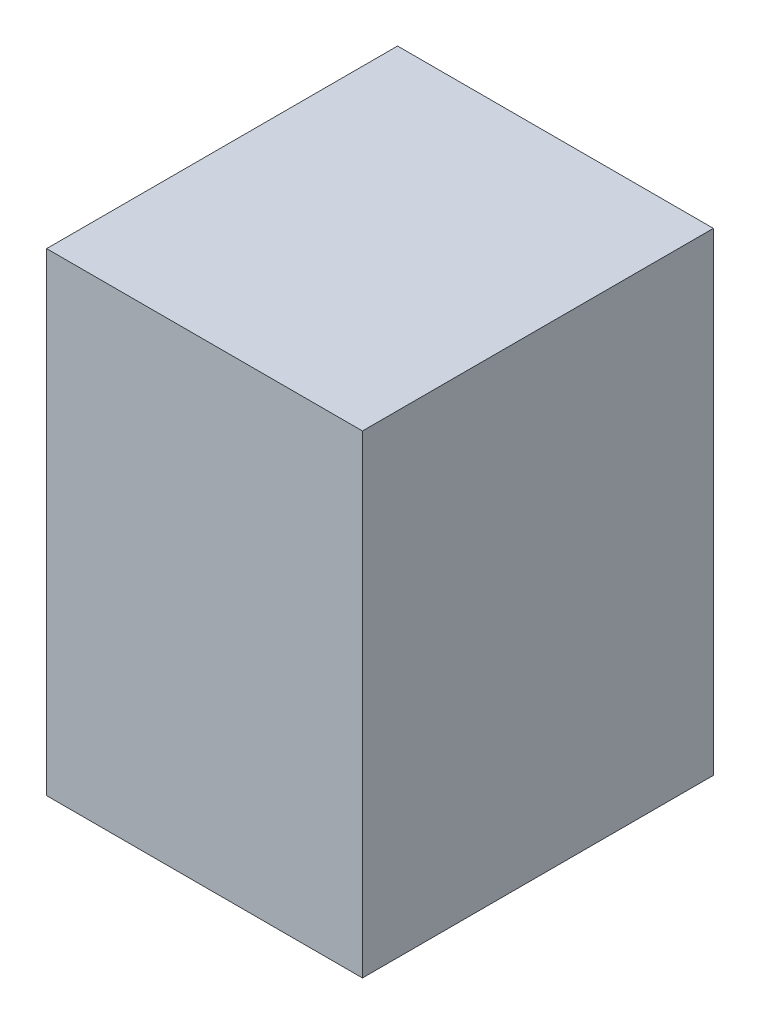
ISO-10303-21;
HEADER;
FILE_DESCRIPTION(('STEP AP214'),'2;1');
FILE_NAME('part.step','',(''),(''),'','','');
FILE_SCHEMA(('AUTOMOTIVE_DESIGN { 1 0 10303 214 1 1 1 1 }'));
ENDSEC;
DATA;
#1=APPLICATION_CONTEXT('core data for automotive mechanical design processes');
#2=APPLICATION_PROTOCOL_DEFINITION('international standard','automotive_design',2000,#1);
#3=PRODUCT_CONTEXT('',#1,'mechanical');
#4=PRODUCT('Part','Part','',(#3));
#5=PRODUCT_RELATED_PRODUCT_CATEGORY('part','',(#4));
#6=PRODUCT_DEFINITION_FORMATION('','',#4);
#7=PRODUCT_DEFINITION_CONTEXT('part definition',#1,'design');
#8=PRODUCT_DEFINITION('design','',#6,#7);
#9=PRODUCT_DEFINITION_SHAPE('','',#8);
#10=(LENGTH_UNIT() NAMED_UNIT(*) SI_UNIT(.MILLI.,.METRE.));
#11=(NAMED_UNIT(*) PLANE_ANGLE_UNIT() SI_UNIT($,.RADIAN.));
#12=(NAMED_UNIT(*) SI_UNIT($,.STERADIAN.) SOLID_ANGLE_UNIT());
#13=UNCERTAINTY_MEASURE_WITH_UNIT(LENGTH_MEASURE(1.E-05),#10,'distance_accuracy_value','');
#14=(GEOMETRIC_REPRESENTATION_CONTEXT(3) GLOBAL_UNCERTAINTY_ASSIGNED_CONTEXT((#13)) GLOBAL_UNIT_ASSIGNED_CONTEXT((#10,
#11,#12)) REPRESENTATION_CONTEXT('',''));
#15=CARTESIAN_POINT('',(0.,0.,0.));
#16=DIRECTION('',(0.,0.,1.));
#17=DIRECTION('',(1.,0.,0.));
#18=AXIS2_PLACEMENT_3D('',#15,#16,#17);
#19=CARTESIAN_POINT('',(1.2700000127E-06,0.,1.00000054));
#20=DIRECTION('',(0.,0.,1.));
#21=DIRECTION('',(1.,0.,0.));
#22=AXIS2_PLACEMENT_3D('',#19,#20,#21);
#23=PLANE('',#22);
#24=DIRECTION('',(-1.,0.,0.));
#25=VECTOR('',#24,1.);
#26=CARTESIAN_POINT('',(0.45000164,0.67499992,1.00000054));
#27=LINE('',#26,#25);
#28=CARTESIAN_POINT('',(0.45000164,0.67499992,1.00000054));
#29=VERTEX_POINT('',#28);
#30=CARTESIAN_POINT('',(-0.4499991,0.67499992,1.00000054));
#31=VERTEX_POINT('',#30);
#32=EDGE_CURVE('E85',#29,#31,#27,.T.);
#33=ORIENTED_EDGE('',*,*,#32,.T.);
#34=DIRECTION('',(0.,-1.,0.));
#35=VECTOR('',#34,1.);
#36=CARTESIAN_POINT('',(-0.4499991,0.67499992,1.00000054));
#37=LINE('',#36,#35);
#38=CARTESIAN_POINT('',(-0.4499991,-0.67499992,1.00000054));
#39=VERTEX_POINT('',#38);
#40=EDGE_CURVE('E103',#31,#39,#37,.T.);
#41=ORIENTED_EDGE('',*,*,#40,.T.);
#42=DIRECTION('',(1.,0.,0.));
#43=VECTOR('',#42,1.);
#44=CARTESIAN_POINT('',(-0.4499991,-0.67499992,1.00000054));
#45=LINE('',#44,#43);
#46=CARTESIAN_POINT('',(0.45000164,-0.67499992,1.00000054));
#47=VERTEX_POINT('',#46);
#48=EDGE_CURVE('E50',#39,#47,#45,.T.);
#49=ORIENTED_EDGE('',*,*,#48,.T.);
#50=DIRECTION('',(0.,1.,0.));
#51=VECTOR('',#50,1.);
#52=CARTESIAN_POINT('',(0.45000164,-0.67499992,1.00000054));
#53=LINE('',#52,#51);
#54=EDGE_CURVE('E11',#47,#29,#53,.T.);
#55=ORIENTED_EDGE('',*,*,#54,.T.);
#56=EDGE_LOOP('',(#33,#41,#49,#55));
#57=FACE_BOUND('',#56,.T.);
#58=ADVANCED_FACE('F17',(#57),#23,.T.);
#59=CARTESIAN_POINT('',(1.2700000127E-06,0.,0.));
#60=DIRECTION('',(0.,0.,1.));
#61=DIRECTION('',(1.,0.,0.));
#62=AXIS2_PLACEMENT_3D('',#59,#60,#61);
#63=PLANE('',#62);
#64=DIRECTION('',(0.,1.,0.));
#65=VECTOR('',#64,1.);
#66=CARTESIAN_POINT('',(0.45000164,-0.67499992,0.));
#67=LINE('',#66,#65);
#68=CARTESIAN_POINT('',(0.45000164,-0.67499992,0.));
#69=VERTEX_POINT('',#68);
#70=CARTESIAN_POINT('',(0.45000164,0.67499992,0.));
#71=VERTEX_POINT('',#70);
#72=EDGE_CURVE('E26',#69,#71,#67,.T.);
#73=ORIENTED_EDGE('',*,*,#72,.F.);
#74=DIRECTION('',(1.,0.,0.));
#75=VECTOR('',#74,1.);
#76=CARTESIAN_POINT('',(-0.4499991,-0.67499992,0.));
#77=LINE('',#76,#75);
#78=CARTESIAN_POINT('',(-0.4499991,-0.67499992,0.));
#79=VERTEX_POINT('',#78);
#80=EDGE_CURVE('E59',#79,#69,#77,.T.);
#81=ORIENTED_EDGE('',*,*,#80,.F.);
#82=DIRECTION('',(0.,-1.,0.));
#83=VECTOR('',#82,1.);
#84=CARTESIAN_POINT('',(-0.4499991,0.67499992,0.));
#85=LINE('',#84,#83);
#86=CARTESIAN_POINT('',(-0.4499991,0.67499992,0.));
#87=VERTEX_POINT('',#86);
#88=EDGE_CURVE('E87',#87,#79,#85,.T.);
#89=ORIENTED_EDGE('',*,*,#88,.F.);
#90=DIRECTION('',(-1.,0.,0.));
#91=VECTOR('',#90,1.);
#92=CARTESIAN_POINT('',(0.45000164,0.67499992,0.));
#93=LINE('',#92,#91);
#94=EDGE_CURVE('E83',#71,#87,#93,.T.);
#95=ORIENTED_EDGE('',*,*,#94,.F.);
#96=EDGE_LOOP('',(#73,#81,#89,#95));
#97=FACE_BOUND('',#96,.T.);
#98=ADVANCED_FACE('F89',(#97),#63,.F.);
#99=CARTESIAN_POINT('',(0.45000164,-0.67499992,0.));
#100=DIRECTION('',(-1.,0.,0.));
#101=DIRECTION('',(0.,0.,1.));
#102=AXIS2_PLACEMENT_3D('',#99,#100,#101);
#103=PLANE('',#102);
#104=ORIENTED_EDGE('',*,*,#72,.T.);
#105=DIRECTION('',(0.,0.,1.));
#106=VECTOR('',#105,1.);
#107=CARTESIAN_POINT('',(0.45000164,0.67499992,0.));
#108=LINE('',#107,#106);
#109=EDGE_CURVE('E74',#71,#29,#108,.T.);
#110=ORIENTED_EDGE('',*,*,#109,.T.);
#111=ORIENTED_EDGE('',*,*,#54,.F.);
#112=DIRECTION('',(0.,0.,1.));
#113=VECTOR('',#112,1.);
#114=CARTESIAN_POINT('',(0.45000164,-0.67499992,0.));
#115=LINE('',#114,#113);
#116=EDGE_CURVE('E76',#69,#47,#115,.T.);
#117=ORIENTED_EDGE('',*,*,#116,.F.);
#118=EDGE_LOOP('',(#104,#110,#111,#117));
#119=FACE_BOUND('',#118,.T.);
#120=ADVANCED_FACE('F73',(#119),#103,.F.);
#121=CARTESIAN_POINT('',(-0.4499991,-0.67499992,0.));
#122=DIRECTION('',(0.,1.,0.));
#123=DIRECTION('',(1.,0.,0.));
#124=AXIS2_PLACEMENT_3D('',#121,#122,#123);
#125=PLANE('',#124);
#126=ORIENTED_EDGE('',*,*,#80,.T.);
#127=ORIENTED_EDGE('',*,*,#116,.T.);
#128=ORIENTED_EDGE('',*,*,#48,.F.);
#129=DIRECTION('',(0.,0.,1.));
#130=VECTOR('',#129,1.);
#131=CARTESIAN_POINT('',(-0.4499991,-0.67499992,0.));
#132=LINE('',#131,#130);
#133=EDGE_CURVE('E106',#79,#39,#132,.T.);
#134=ORIENTED_EDGE('',*,*,#133,.F.);
#135=EDGE_LOOP('',(#126,#127,#128,#134));
#136=FACE_BOUND('',#135,.T.);
#137=ADVANCED_FACE('F120',(#136),#125,.F.);
#138=CARTESIAN_POINT('',(-0.4499991,0.67499992,0.));
#139=DIRECTION('',(1.,0.,0.));
#140=DIRECTION('',(0.,1.,0.));
#141=AXIS2_PLACEMENT_3D('',#138,#139,#140);
#142=PLANE('',#141);
#143=ORIENTED_EDGE('',*,*,#88,.T.);
#144=ORIENTED_EDGE('',*,*,#133,.T.);
#145=ORIENTED_EDGE('',*,*,#40,.F.);
#146=DIRECTION('',(0.,0.,1.));
#147=VECTOR('',#146,1.);
#148=CARTESIAN_POINT('',(-0.4499991,0.67499992,0.));
#149=LINE('',#148,#147);
#150=EDGE_CURVE('E93',#87,#31,#149,.T.);
#151=ORIENTED_EDGE('',*,*,#150,.F.);
#152=EDGE_LOOP('',(#143,#144,#145,#151));
#153=FACE_BOUND('',#152,.T.);
#154=ADVANCED_FACE('F122',(#153),#142,.F.);
#155=CARTESIAN_POINT('',(0.45000164,0.67499992,0.));
#156=DIRECTION('',(0.,-1.,0.));
#157=DIRECTION('',(0.,0.,-1.));
#158=AXIS2_PLACEMENT_3D('',#155,#156,#157);
#159=PLANE('',#158);
#160=ORIENTED_EDGE('',*,*,#94,.T.);
#161=ORIENTED_EDGE('',*,*,#150,.T.);
#162=ORIENTED_EDGE('',*,*,#32,.F.);
#163=ORIENTED_EDGE('',*,*,#109,.F.);
#164=EDGE_LOOP('',(#160,#161,#162,#163));
#165=FACE_BOUND('',#164,.T.);
#166=ADVANCED_FACE('F81',(#165),#159,.F.);
#167=CLOSED_SHELL('',(#58,#98,#120,#137,#154,#166));
#168=MANIFOLD_SOLID_BREP('B1',#167);
#169=ADVANCED_BREP_SHAPE_REPRESENTATION('',(#18,#168),#14);
#170=SHAPE_DEFINITION_REPRESENTATION(#9,#169);
ENDSEC;
END-ISO-10303-21;
